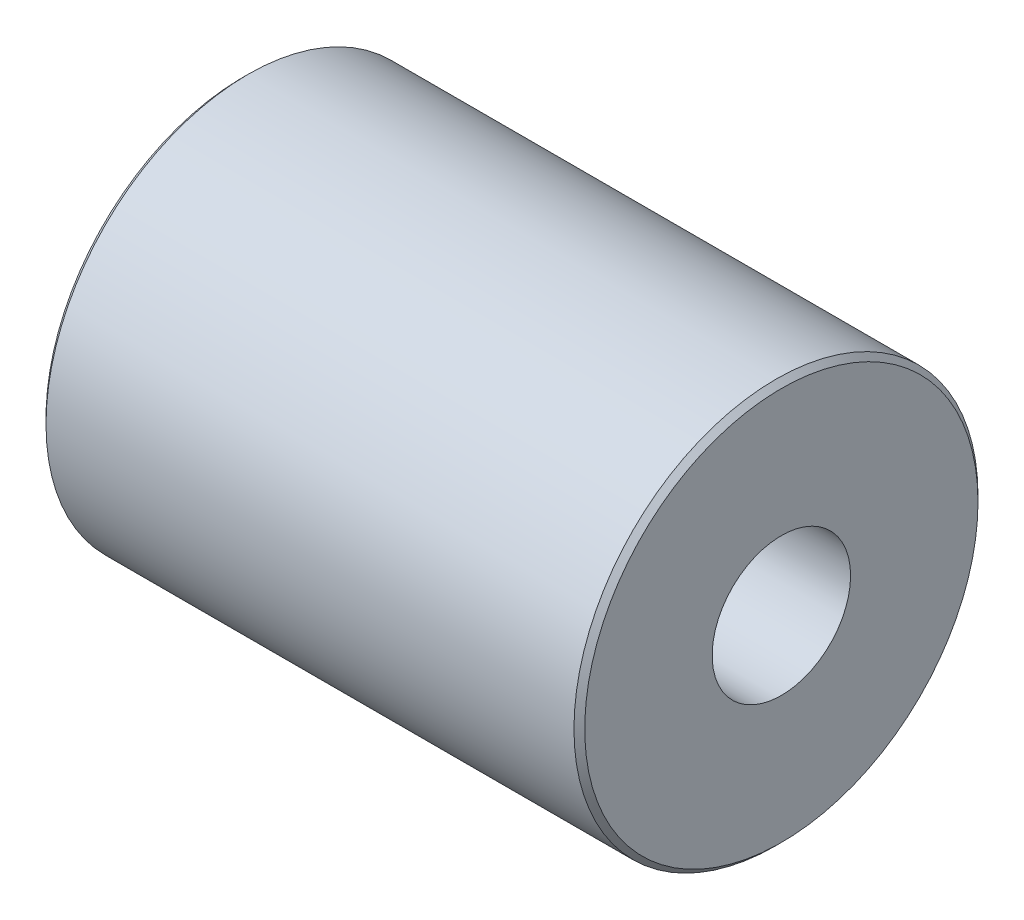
from build123d import *

# Parameters (mm, degrees)
SKETCH1_R               = 9.525
BOSS_EXTRUDE1_DEPTH     = 12.7
F_1_4_CLEARANCE_HOLE1_D = 6.5278
CHAMFER1_SIZE           = 0.254


with BuildPart() as part:
    # Sketch1 → Boss-Extrude1 (new, symmetric)
    with BuildSketch(Plane(origin=(0, 0, 0), x_dir=(0, 0, -1), z_dir=(1, 0, 0))):
        Circle(SKETCH1_R)
    extrude(amount=BOSS_EXTRUDE1_DEPTH, both=True)

    # 1_4 Clearance Hole1 (through all)
    with Locations(Plane(origin=(12.7, 0, 0), x_dir=(0, 0, -1), z_dir=(1, 0, 0))):
        with Locations((0, 0)):
            Hole(F_1_4_CLEARANCE_HOLE1_D / 2)

    # Chamfer1
    chamfer1_edges = [part.edges().sort_by_distance(p)[0] for p in [
        (-12.7, 0, 9.525),
        (12.7, 0, 9.525),
    ]]
    chamfer(chamfer1_edges, length=CHAMFER1_SIZE)


solid = part.part
